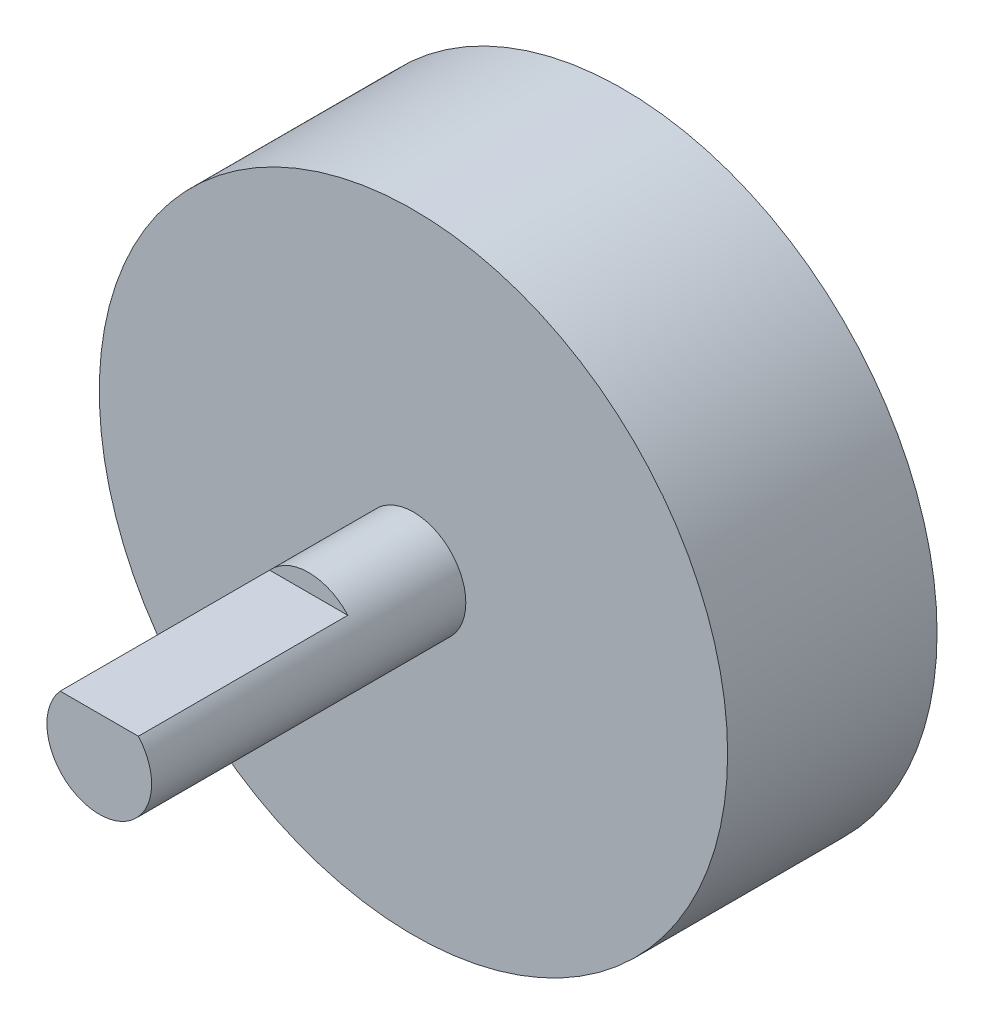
from build123d import *

# Parameters (mm, degrees)
SKETCH1_R           = 19.05
BOSS_EXTRUDE1_DEPTH = 12.7
SKETCH2_R           = 3.175
BOSS_EXTRUDE2_DEPTH = 19.05
SKETCH3_W           = 7.575380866
SKETCH3_H           = 1.446687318
CUT_EXTRUDE1_DEPTH  = 12.7


with BuildPart() as part:
    # Sketch1 → Boss-Extrude1 (new body)
    with BuildSketch(Plane.XY):
        Circle(SKETCH1_R)
    extrude(amount=BOSS_EXTRUDE1_DEPTH)

    # Sketch2 → Boss-Extrude2 (add)
    with BuildSketch(Plane.XY.offset(12.7)):
        with Locations(Location((0, 0, 0), (0, 0, 180))):
            Circle(SKETCH2_R)
    extrude(amount=BOSS_EXTRUDE2_DEPTH)

    # Sketch3 → Cut-Extrude1 (cut)
    with BuildSketch(Plane.XY.offset(31.75)):
        with Locations((0.155919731, 2.835726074)):
            Rectangle(SKETCH3_W, SKETCH3_H)
    extrude(amount=-CUT_EXTRUDE1_DEPTH, mode=Mode.SUBTRACT)


solid = part.part
